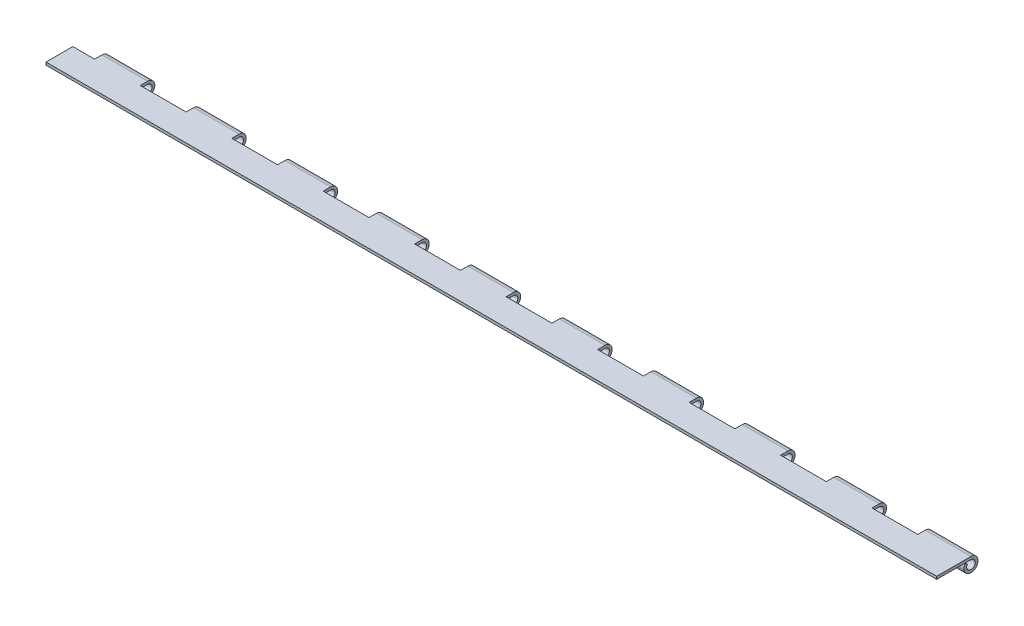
from build123d import *

# Parameters (mm, degrees)
EXTRUDE1_DEPTH     = 1219.2
SKETCH2_W          = 50.927
SKETCH2_H          = 24.426126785
CUT_EXTRUDE1_DEPTH = 1220.895699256
SKETCH3_W          = 250.795613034
SKETCH3_H          = 113.876505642
CUT_EXTRUDE2_DEPTH = 1220.895699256


with BuildPart() as part:
    # Sketch1 → Extrude1 (new body)
    with BuildSketch(Plane(origin=(0, 0, 0), x_dir=(0, 0, -1), z_dir=(1, 0, 0))):
        with BuildLine():
            Line((-4.094609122, 2.471134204), (-6.704198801, 4.046045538))
            ThreePointArc((-6.704198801, 4.046045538), (3.849298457, -6.819066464), (0, 7.830502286))
            Line((0, 7.830502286), (-38.1, 7.830502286))
            Line((-38.1, 7.830502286), (-38.1, 4.782502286))
            Line((-38.1, 4.782502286), (-6.200357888, 4.782502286))
            Line((-6.200357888, 4.782502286), (0, 4.782502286))
            ThreePointArc((0, 4.782502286), (2.350970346, -4.164764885), (-4.094609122, 2.471134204))
        make_face()
    extrude(amount=EXTRUDE1_DEPTH)

    # Sketch2 → Cut-Extrude1 (cut, through all)
    with BuildSketch(Plane(origin=(0, 7.830502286, 0), x_dir=(1, 0, 0), z_dir=(0, 1, 0))):
        with Locations((1142.9365, 3.934324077)):
            Rectangle(SKETCH2_W, SKETCH2_H)
        with Locations((1041.2095, 3.934324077)):
            Rectangle(SKETCH2_W, SKETCH2_H)
        with Locations((939.4825, 3.934324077)):
            Rectangle(SKETCH2_W, SKETCH2_H)
        with Locations((837.7555, 3.934324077)):
            Rectangle(SKETCH2_W, SKETCH2_H)
        with Locations((736.0285, 3.934324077)):
            Rectangle(SKETCH2_W, SKETCH2_H)
        with Locations((634.3015, 3.934324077)):
            Rectangle(SKETCH2_W, SKETCH2_H)
        with Locations((532.5745, 3.934324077)):
            Rectangle(SKETCH2_W, SKETCH2_H)
        with Locations((430.8475, 3.934324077)):
            Rectangle(SKETCH2_W, SKETCH2_H)
        with Locations((329.1205, 3.934324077)):
            Rectangle(SKETCH2_W, SKETCH2_H)
        with Locations((227.3935, 3.934324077)):
            Rectangle(SKETCH2_W, SKETCH2_H)
        with Locations((125.6665, 3.934324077)):
            Rectangle(SKETCH2_W, SKETCH2_H)
        with Locations((23.9395, 3.934324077)):
            Rectangle(SKETCH2_W, SKETCH2_H)
    extrude(amount=-CUT_EXTRUDE1_DEPTH, mode=Mode.SUBTRACT)

    # Sketch3 → Cut-Extrude2 (cut, through all)
    with BuildSketch(Plane(origin=(0, 7.830502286, 0), x_dir=(1, 0, 0), z_dir=(0, 1, 0))):
        with Locations((103.202193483, -20.974569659)):
            Rectangle(SKETCH3_W, SKETCH3_H)
    extrude(amount=-CUT_EXTRUDE2_DEPTH, mode=Mode.SUBTRACT)


solid = part.part
